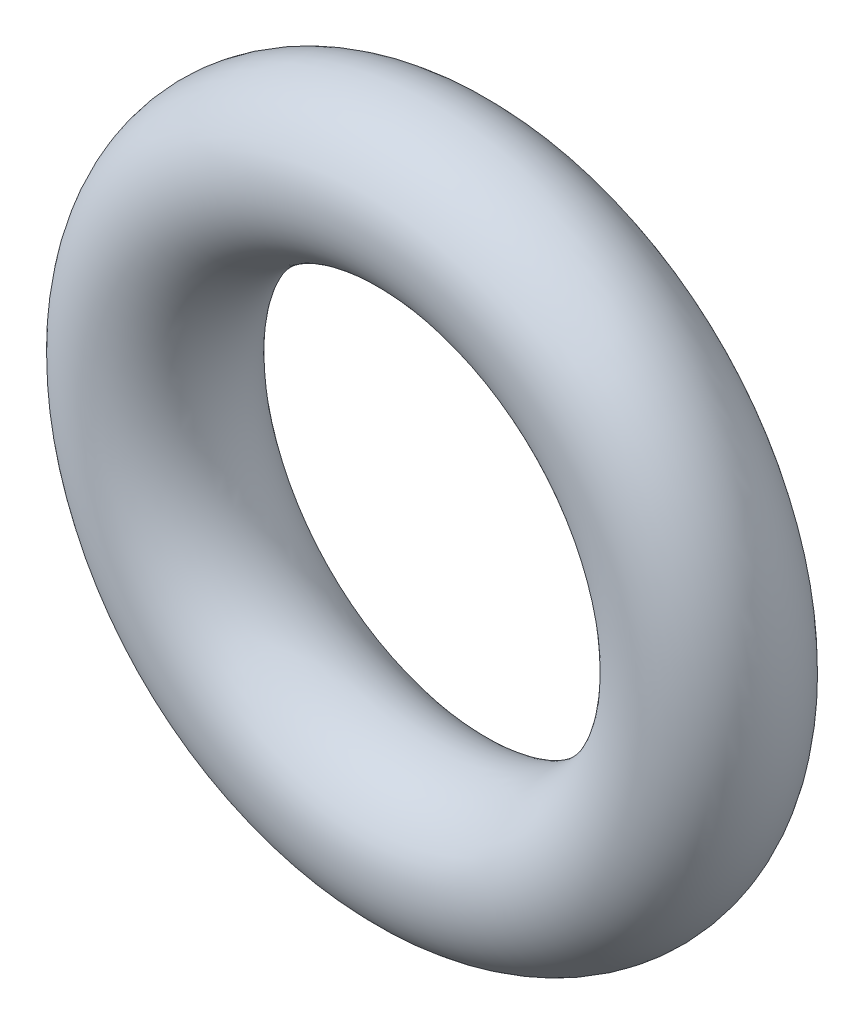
ISO-10303-21;
HEADER;
FILE_DESCRIPTION(('STEP AP214'),'2;1');
FILE_NAME('part.step','',(''),(''),'','','');
FILE_SCHEMA(('AUTOMOTIVE_DESIGN { 1 0 10303 214 1 1 1 1 }'));
ENDSEC;
DATA;
#1=APPLICATION_CONTEXT('core data for automotive mechanical design processes');
#2=APPLICATION_PROTOCOL_DEFINITION('international standard','automotive_design',2000,#1);
#3=PRODUCT_CONTEXT('',#1,'mechanical');
#4=PRODUCT('Part','Part','',(#3));
#5=PRODUCT_RELATED_PRODUCT_CATEGORY('part','',(#4));
#6=PRODUCT_DEFINITION_FORMATION('','',#4);
#7=PRODUCT_DEFINITION_CONTEXT('part definition',#1,'design');
#8=PRODUCT_DEFINITION('design','',#6,#7);
#9=PRODUCT_DEFINITION_SHAPE('','',#8);
#10=(LENGTH_UNIT() NAMED_UNIT(*) SI_UNIT(.MILLI.,.METRE.));
#11=(NAMED_UNIT(*) PLANE_ANGLE_UNIT() SI_UNIT($,.RADIAN.));
#12=(NAMED_UNIT(*) SI_UNIT($,.STERADIAN.) SOLID_ANGLE_UNIT());
#13=UNCERTAINTY_MEASURE_WITH_UNIT(LENGTH_MEASURE(1.E-05),#10,'distance_accuracy_value','');
#14=(GEOMETRIC_REPRESENTATION_CONTEXT(3) GLOBAL_UNCERTAINTY_ASSIGNED_CONTEXT((#13)) GLOBAL_UNIT_ASSIGNED_CONTEXT((#10,
#11,#12)) REPRESENTATION_CONTEXT('',''));
#15=CARTESIAN_POINT('',(0.,0.,0.));
#16=DIRECTION('',(0.,0.,1.));
#17=DIRECTION('',(1.,0.,0.));
#18=AXIS2_PLACEMENT_3D('',#15,#16,#17);
#19=CARTESIAN_POINT('',(-36.,0.,0.));
#20=DIRECTION('',(0.,0.,-1.));
#21=DIRECTION('',(-1.,0.,0.));
#22=AXIS2_PLACEMENT_3D('',#19,#20,#21);
#23=TOROIDAL_SURFACE('',#22,36.,10.);
#24=CARTESIAN_POINT('',(-82.,0.,0.));
#25=VERTEX_POINT('',#24);
#26=VERTEX_LOOP('',#25);
#27=FACE_BOUND('',#26,.T.);
#28=ADVANCED_FACE('F27',(#27),#23,.T.);
#29=CLOSED_SHELL('',(#28));
#30=MANIFOLD_SOLID_BREP('B2',#29);
#31=ADVANCED_BREP_SHAPE_REPRESENTATION('',(#18,#30),#14);
#32=SHAPE_DEFINITION_REPRESENTATION(#9,#31);
ENDSEC;
END-ISO-10303-21;
